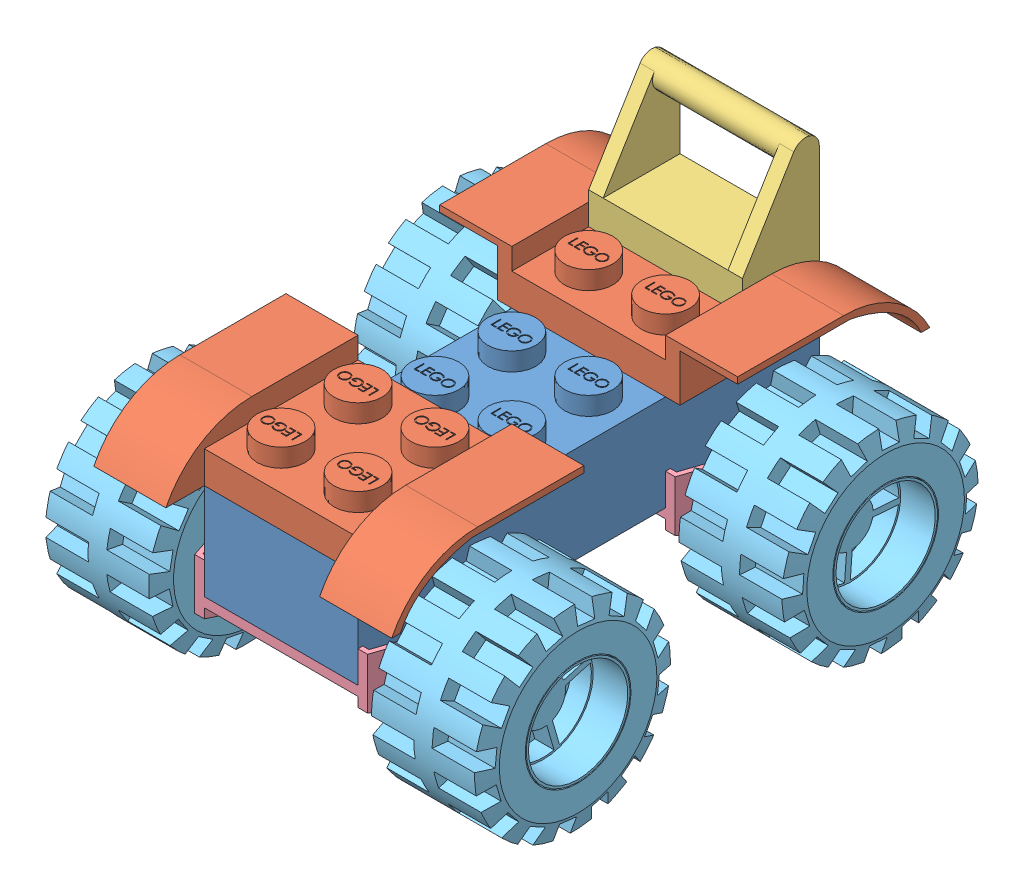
SolidWorks assembly Assem1_WithoutColor.SLDASM, configuration Default (file format 11000). Lengths in mm.
Overall size (45.8 39.27 58.64).
10 component instances, 5 part files, 23 mates.
Components (placement in the parent):
- Lego_Base-1: Lego_Base.SLDPRT [Valor predeterminado] at (5.3147 20.7135 62.1759) size (16 11.9 48)
- Lego_Fron_Back-1: Lego_Fron_Back.SLDPRT [Valor predeterminado] at (5.3147 24.0469 30.1759) size (31 5.56 20)
- Lego_Top-1: Lego_Top.SLDPRT [Valor predeterminado] at (21.3147 34.0469 22.1759) size (16 12.77 8)
- Lego_WheelHolder-1: Lego_WheelHolder.SLDPRT [Valor predeterminado] at (5.3147 10.7135 30.1759) size (32.6 6.3 16)
- Wheel-1: Wheel.SLDPRT [Valor predeterminado] at (-9.5853 20.8635 54.1759) x (0 0.381849 -0.924225) z (0 -0.924225 -0.381849) size (20.4 11.9 20.4)
- Lego_WheelHolder-2: Lego_WheelHolder.SLDPRT [Valor predeterminado] at (5.3147 10.7135 62.1759) size (32.6 6.3 16)
- Lego_Fron_Back-2: Lego_Fron_Back.SLDPRT [Valor predeterminado] at (21.3147 24.0469 46.1759) x (-1 0 0) z (0 0 -1) size (31 5.56 20)
- Wheel-2: Wheel.SLDPRT [Valor predeterminado] at (-9.5853 20.8635 22.1759) x (0 0.381849 -0.924225) z (0 -0.924225 -0.381849) size (20.4 11.9 20.4)
- Wheel-3: Wheel.SLDPRT [Valor predeterminado] at (36.2147 20.8635 22.1759) x (0 0.997172 -0.075154) z (0 0.075154 0.997172) size (20.4 11.9 20.4)
- Wheel-4: Wheel.SLDPRT [Valor predeterminado] at (36.2147 20.8635 54.1759) x (0 0.960615 0.277884) z (0 -0.277884 0.960615) size (20.4 11.9 20.4)
Mates (geometry in assembly coordinates):
- Coincident1: coincident: plane of Lego_Base-1 through (5.3147 30.7135 62.1759) normal (0 0 1); plane of Lego_WheelHolder-2 through (5.3147 20.7135 62.1759) normal (0 0 1)
- Coincident2: coincident: plane of Lego_Base-1 through (5.3147 20.7135 62.1759) normal (0 -1 0); plane of Lego_WheelHolder-2 through (5.3147 20.7135 62.1759) normal (0 1 0)
- Coincident3: coincident: plane of Lego_Base-1 through (5.3147 30.7135 62.1759) normal (-1 0 0); plane of Lego_WheelHolder-2 through (5.3147 17.3801 38.8956) normal (1 0 0)
- Coincident4: coincident: plane of Lego_Base-1 through (5.3147 20.7135 62.1759) normal (0 -1 0); plane of Lego_WheelHolder-1 through (5.3147 20.7135 30.1759) normal (0 1 0)
- Coincident5: coincident: plane of Lego_Base-1 through (5.3147 30.7135 14.1759) normal (0 0 -1); line of Lego_WheelHolder-1 through (5.3147 19.7135 14.1759) axis (1 0 0)
- Coincident6: coincident: plane of Lego_Base-1 through (5.3147 30.7135 62.1759) normal (-1 0 0); plane of Lego_WheelHolder-1 through (5.3147 17.3801 6.8956) normal (1 0 0)
- Coincident7: coincident: plane of Lego_Base-1 through (5.3147 30.7135 14.1759) normal (0 0 -1); plane of Lego_Fron_Back-1 through (1.3147 24.0469 14.1759) normal (0 0 -1)
- Coincident8: coincident: plane of Lego_Base-1 through (5.3147 30.7135 62.1759) normal (0 1 0); plane of Lego_Fron_Back-1 through (1.3147 30.7135 30.1759) normal (0 -1 0)
- Coincident9: coincident: plane of Lego_Base-1 through (5.3147 30.7135 62.1759) normal (-1 0 0); plane of Lego_Fron_Back-1 through (5.3147 30.7135 10.1759) normal (1 0 0)
- Coincident10: coincident: plane of Lego_Base-1 through (5.3147 30.7135 62.1759) normal (0 0 1); plane of Lego_Fron_Back-2 through (25.3147 24.0469 62.1759) normal (0 0 1)
- Coincident11: coincident: plane of Lego_Base-1 through (21.3147 30.7135 62.1759) normal (1 0 0); plane of Lego_Fron_Back-2 through (21.3147 30.7135 66.1759) normal (-1 0 0)
- Coincident12: coincident: plane of Lego_Base-1 through (5.3147 30.7135 62.1759) normal (0 1 0); plane of Lego_Fron_Back-2 through (25.3147 30.7135 46.1759) normal (0 -1 0)
- Coincident13: coincident: plane of Lego_Fron_Back-1 through (21.3147 30.7135 10.1759) normal (-1 0 0); plane of Lego_Top-1 through (21.3147 37.3803 22.1759) normal (1 0 0)
- Coincident14: coincident: plane of Lego_Fron_Back-1 through (5.3147 34.0469 30.1759) normal (0 1 0); plane of Lego_Top-1 through (21.3147 34.0469 22.1759) normal (0 -1 0)
- Coincident16: coincident: plane of Lego_Fron_Back-1 through (1.3147 24.0469 14.1759) normal (0 0 -1); plane of Lego_Top-1 through (21.3147 37.3803 14.1759) normal (0 0 -1)
- Concentric1: concentric: cylinder of Wheel-1 through (-2.6853 20.8635 54.1759) axis (1 0 0) radius 1.6; cylinder of Lego_WheelHolder-2 through (-2.6853 20.8635 54.1759) axis (1 0 0) radius 1.6
- Coincident17: coincident: plane of Wheel-1 through (2.3147 24.7584 44.7488) normal (1 0 0); plane of Lego_WheelHolder-2 through (2.3147 17.3801 38.8956) normal (-1 0 0)
- Concentric2: concentric: cylinder of Lego_WheelHolder-1 through (-2.6853 20.8635 22.1759) axis (1 0 0) radius 1.6; cylinder of Wheel-2 through (-2.6853 20.8635 22.1759) axis (1 0 0) radius 1.6
- Coincident18: coincident: plane of Lego_WheelHolder-1 through (2.3147 17.3801 6.8956) normal (-1 0 0); plane of Wheel-2 through (2.3147 24.7584 12.7488) normal (1 0 0)
- Concentric3: concentric: cylinder of Lego_WheelHolder-2 through (29.3147 20.8635 54.1759) axis (-1 0 0) radius 1.6; cylinder of Wheel-4 through (29.3147 20.8635 54.1759) axis (-1 0 0) radius 1.6
- Concentric5: concentric: cylinder of Lego_WheelHolder-1 through (29.3147 20.8635 22.1759) axis (-1 0 0) radius 1.6; cylinder of Wheel-3 through (29.3147 20.8635 22.1759) axis (-1 0 0) radius 1.6
- Coincident19: coincident: plane of Lego_WheelHolder-2 through (24.3147 17.3801 38.8956) normal (1 0 0); plane of Wheel-4 through (24.3147 30.6618 57.0103) normal (-1 0 0)
- Coincident20: coincident: plane of Lego_WheelHolder-1 through (24.3147 17.3801 6.8956) normal (1 0 0); plane of Wheel-3 through (24.3147 31.0347 21.4093) normal (-1 0 0)
